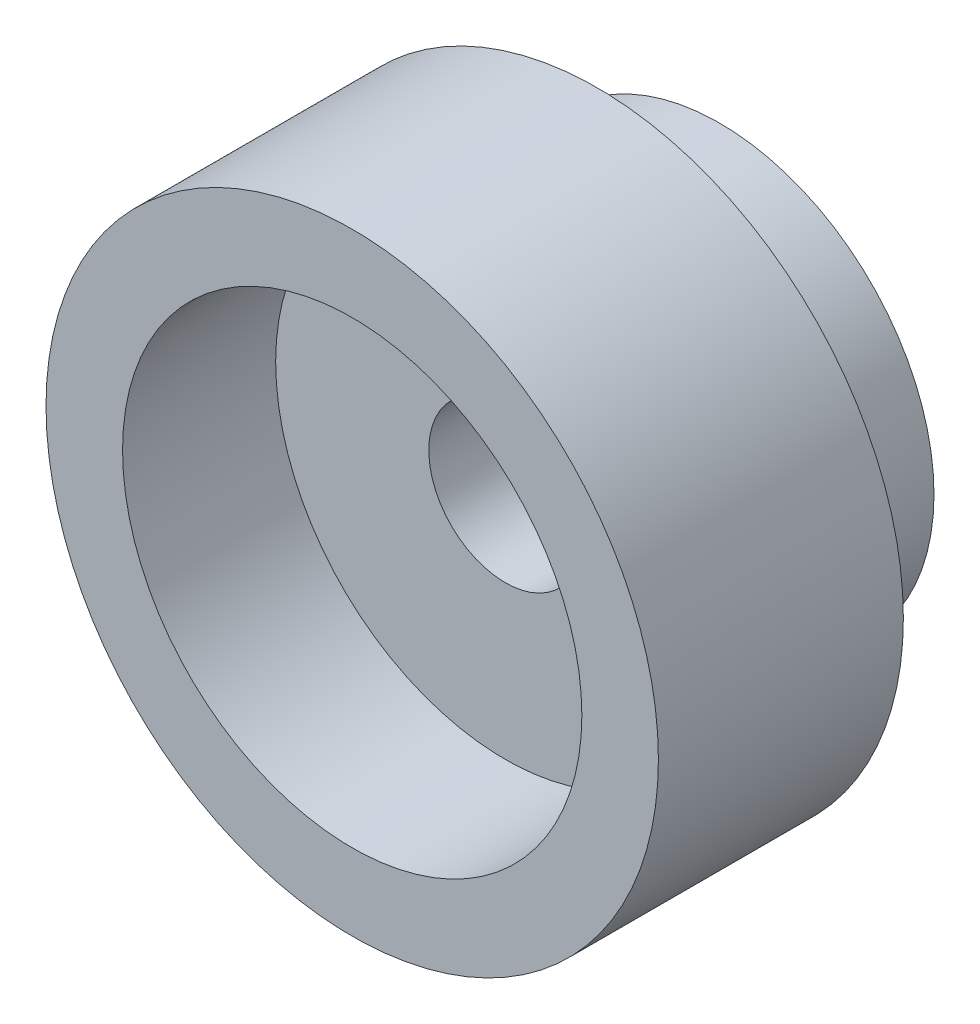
ISO-10303-21;
HEADER;
FILE_DESCRIPTION(('STEP AP214'),'2;1');
FILE_NAME('part.step','',(''),(''),'','','');
FILE_SCHEMA(('AUTOMOTIVE_DESIGN { 1 0 10303 214 1 1 1 1 }'));
ENDSEC;
DATA;
#1=APPLICATION_CONTEXT('core data for automotive mechanical design processes');
#2=APPLICATION_PROTOCOL_DEFINITION('international standard','automotive_design',2000,#1);
#3=PRODUCT_CONTEXT('',#1,'mechanical');
#4=PRODUCT('Part','Part','',(#3));
#5=PRODUCT_RELATED_PRODUCT_CATEGORY('part','',(#4));
#6=PRODUCT_DEFINITION_FORMATION('','',#4);
#7=PRODUCT_DEFINITION_CONTEXT('part definition',#1,'design');
#8=PRODUCT_DEFINITION('design','',#6,#7);
#9=PRODUCT_DEFINITION_SHAPE('','',#8);
#10=(LENGTH_UNIT() NAMED_UNIT(*) SI_UNIT(.MILLI.,.METRE.));
#11=(NAMED_UNIT(*) PLANE_ANGLE_UNIT() SI_UNIT($,.RADIAN.));
#12=(NAMED_UNIT(*) SI_UNIT($,.STERADIAN.) SOLID_ANGLE_UNIT());
#13=UNCERTAINTY_MEASURE_WITH_UNIT(LENGTH_MEASURE(1.E-05),#10,'distance_accuracy_value','');
#14=(GEOMETRIC_REPRESENTATION_CONTEXT(3) GLOBAL_UNCERTAINTY_ASSIGNED_CONTEXT((#13)) GLOBAL_UNIT_ASSIGNED_CONTEXT((#10,
#11,#12)) REPRESENTATION_CONTEXT('',''));
#15=CARTESIAN_POINT('',(0.,0.,0.));
#16=DIRECTION('',(0.,0.,1.));
#17=DIRECTION('',(1.,0.,0.));
#18=AXIS2_PLACEMENT_3D('',#15,#16,#17);
#19=CARTESIAN_POINT('',(0.,0.,20.));
#20=DIRECTION('',(0.,0.,1.));
#21=DIRECTION('',(1.,0.,0.));
#22=AXIS2_PLACEMENT_3D('',#19,#20,#21);
#23=CYLINDRICAL_SURFACE('',#22,7.);
#24=CARTESIAN_POINT('',(0.,0.,0.));
#25=DIRECTION('',(0.,0.,1.));
#26=DIRECTION('',(1.,0.,0.));
#27=AXIS2_PLACEMENT_3D('',#24,#25,#26);
#28=CIRCLE('',#27,7.);
#29=CARTESIAN_POINT('',(7.,0.,0.));
#30=VERTEX_POINT('',#29);
#31=EDGE_CURVE('E8',#30,#30,#28,.T.);
#32=ORIENTED_EDGE('',*,*,#31,.T.);
#33=EDGE_LOOP('',(#32));
#34=FACE_BOUND('',#33,.T.);
#35=CARTESIAN_POINT('',(0.,0.,4.));
#36=DIRECTION('',(0.,0.,1.));
#37=DIRECTION('',(1.,0.,0.));
#38=AXIS2_PLACEMENT_3D('',#35,#36,#37);
#39=CIRCLE('',#38,7.);
#40=CARTESIAN_POINT('',(7.,0.,4.));
#41=VERTEX_POINT('',#40);
#42=EDGE_CURVE('E25',#41,#41,#39,.T.);
#43=ORIENTED_EDGE('',*,*,#42,.F.);
#44=EDGE_LOOP('',(#43));
#45=FACE_BOUND('',#44,.T.);
#46=CARTESIAN_POINT('',(0.,7.,1.8));
#47=CARTESIAN_POINT('',(-0.0392142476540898,6.99999954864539,1.80000169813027));
#48=CARTESIAN_POINT('',(-0.0784544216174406,6.99966697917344,1.80330628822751));
#49=CARTESIAN_POINT('',(-0.155846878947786,6.99837227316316,1.8164390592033));
#50=CARTESIAN_POINT('',(-0.19399791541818,6.99740944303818,1.82627442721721));
#51=CARTESIAN_POINT('',(-0.26808017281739,6.99496290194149,1.85217956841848));
#52=CARTESIAN_POINT('',(-0.304012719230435,6.99347950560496,1.86824557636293));
#53=CARTESIAN_POINT('',(-0.372663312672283,6.99015770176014,1.90614863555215));
#54=CARTESIAN_POINT('',(-0.405381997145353,6.98831936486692,1.92798453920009));
#55=CARTESIAN_POINT('',(-0.466801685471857,6.98448621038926,1.97689188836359));
#56=CARTESIAN_POINT('',(-0.495489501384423,6.98249091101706,2.00397985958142));
#57=CARTESIAN_POINT('',(-0.547919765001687,6.97857269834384,2.06258717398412));
#58=CARTESIAN_POINT('',(-0.571661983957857,6.97664978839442,2.09410672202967));
#59=CARTESIAN_POINT('',(-0.613573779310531,6.97308914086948,2.16076497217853));
#60=CARTESIAN_POINT('',(-0.631731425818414,6.97145201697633,2.1959112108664));
#61=CARTESIAN_POINT('',(-0.66188246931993,6.96865426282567,2.26877291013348));
#62=CARTESIAN_POINT('',(-0.673876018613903,6.96749362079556,2.30648830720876));
#63=CARTESIAN_POINT('',(-0.691319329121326,6.96578458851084,2.3832832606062));
#64=CARTESIAN_POINT('',(-0.696790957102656,6.96523415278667,2.42235780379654));
#65=CARTESIAN_POINT('',(-0.701102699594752,6.96480150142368,2.50087420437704));
#66=CARTESIAN_POINT('',(-0.69994298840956,6.96491926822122,2.54031605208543));
#67=CARTESIAN_POINT('',(-0.691042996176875,6.96580784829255,2.61829671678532));
#68=CARTESIAN_POINT('',(-0.683326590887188,6.96657629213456,2.65683828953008));
#69=CARTESIAN_POINT('',(-0.661569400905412,6.96867594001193,2.73207657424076));
#70=CARTESIAN_POINT('',(-0.647528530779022,6.97000715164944,2.76877326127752));
#71=CARTESIAN_POINT('',(-0.613494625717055,6.97308506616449,2.83935551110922));
#72=CARTESIAN_POINT('',(-0.593490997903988,6.9748325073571,2.87323593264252));
#73=CARTESIAN_POINT('',(-0.548107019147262,6.97854536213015,2.93716765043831));
#74=CARTESIAN_POINT('',(-0.522726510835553,6.9805107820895,2.96721883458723));
#75=CARTESIAN_POINT('',(-0.467175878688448,6.98444869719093,3.02277777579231));
#76=CARTESIAN_POINT('',(-0.436985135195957,6.98642118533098,3.04826492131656));
#77=CARTESIAN_POINT('',(-0.372742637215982,6.99014280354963,3.09381254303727));
#78=CARTESIAN_POINT('',(-0.338690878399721,6.99189193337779,3.11387301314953));
#79=CARTESIAN_POINT('',(-0.267678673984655,6.99497032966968,3.14799701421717));
#80=CARTESIAN_POINT('',(-0.230717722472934,6.99629952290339,3.16205949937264));
#81=CARTESIAN_POINT('',(-0.154943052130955,6.99838753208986,3.18377324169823));
#82=CARTESIAN_POINT('',(-0.116129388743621,6.99914636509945,3.19142469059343));
#83=CARTESIAN_POINT('',(-0.0379295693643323,7.00000596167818,3.20007301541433));
#84=CARTESIAN_POINT('',(0.00145341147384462,7.00010953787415,3.20109833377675));
#85=CARTESIAN_POINT('',(0.0798306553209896,6.99965449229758,3.19653999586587));
#86=CARTESIAN_POINT('',(0.118824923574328,6.99909587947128,3.1909564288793));
#87=CARTESIAN_POINT('',(0.195235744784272,6.99738103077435,3.17336241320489));
#88=CARTESIAN_POINT('',(0.232655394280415,6.99622603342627,3.16136528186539));
#89=CARTESIAN_POINT('',(0.304951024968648,6.99344799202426,3.13129837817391));
#90=CARTESIAN_POINT('',(0.339826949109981,6.99182493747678,3.11322846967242));
#91=CARTESIAN_POINT('',(0.406173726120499,6.98828532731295,3.07145841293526));
#92=CARTESIAN_POINT('',(0.437632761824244,6.98636780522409,3.04773957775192));
#93=CARTESIAN_POINT('',(0.496133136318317,6.98245753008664,2.99537175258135));
#94=CARTESIAN_POINT('',(0.523174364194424,6.9804647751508,2.96672263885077));
#95=CARTESIAN_POINT('',(0.572170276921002,6.97662016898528,2.9051833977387));
#96=CARTESIAN_POINT('',(0.594106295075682,6.97476885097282,2.87227837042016));
#97=CARTESIAN_POINT('',(0.632140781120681,6.97142482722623,2.80323484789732));
#98=CARTESIAN_POINT('',(0.648239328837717,6.96993211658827,2.76709639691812));
#99=CARTESIAN_POINT('',(0.674110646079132,6.96747763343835,2.69267588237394));
#100=CARTESIAN_POINT('',(0.683894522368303,6.96651492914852,2.65439771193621));
#101=CARTESIAN_POINT('',(0.696894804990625,6.96522655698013,2.57673176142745));
#102=CARTESIAN_POINT('',(0.700111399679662,6.9649008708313,2.53734401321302));
#103=CARTESIAN_POINT('',(0.699883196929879,6.96492379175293,2.4587625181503));
#104=CARTESIAN_POINT('',(0.696467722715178,6.96526943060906,2.41956868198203));
#105=CARTESIAN_POINT('',(0.683133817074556,6.96658972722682,2.3423145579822));
#106=CARTESIAN_POINT('',(0.673215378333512,6.96756438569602,2.30425427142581));
#107=CARTESIAN_POINT('',(0.647165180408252,6.9700320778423,2.2303478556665));
#108=CARTESIAN_POINT('',(0.631034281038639,6.97152503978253,2.19450142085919));
#109=CARTESIAN_POINT('',(0.593020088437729,6.97486126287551,2.12602017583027));
#110=CARTESIAN_POINT('',(0.57113682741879,6.97670452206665,2.09338534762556));
#111=CARTESIAN_POINT('',(0.522128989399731,6.98054341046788,2.03210342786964));
#112=CARTESIAN_POINT('',(0.494982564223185,6.98253965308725,2.00347384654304));
#113=CARTESIAN_POINT('',(0.436262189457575,6.98645398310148,1.95116343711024));
#114=CARTESIAN_POINT('',(0.40468718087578,6.98837205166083,1.92748379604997));
#115=CARTESIAN_POINT('',(0.337919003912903,6.99191893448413,1.88569858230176));
#116=CARTESIAN_POINT('',(0.302716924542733,6.99354700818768,1.86760719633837));
#117=CARTESIAN_POINT('',(0.229780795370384,6.99632240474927,1.83761630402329));
#118=CARTESIAN_POINT('',(0.192049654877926,6.99747026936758,1.82570981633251));
#119=CARTESIAN_POINT('',(0.128420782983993,6.99886749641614,1.81139556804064));
#120=CARTESIAN_POINT('',(0.102929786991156,6.99929020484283,1.80712806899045));
#121=CARTESIAN_POINT('',(0.0516296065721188,6.9998566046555,1.80142973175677));
#122=CARTESIAN_POINT('',(0.0258204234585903,7.00000029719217,1.7999988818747));
#123=CARTESIAN_POINT('',(0.,7.,1.8));
#124=B_SPLINE_CURVE_WITH_KNOTS('',3,(#46,#47,#48,#49,#50,#51,#52,#53,#54,#55,#56,#57,#58,#59,
#60,#61,#62,#63,#64,#65,#66,#67,#68,#69,#70,#71,#72,#73,#74,#75,#76,#77,#78,#79,#80,#81,#82,#83,
#84,#85,#86,#87,#88,#89,#90,#91,#92,#93,#94,#95,#96,#97,#98,#99,#100,#101,#102,#103,#104,#105,
#106,#107,#108,#109,#110,#111,#112,#113,#114,#115,#116,#117,#118,#119,#120,#121,#122,#123),
.UNSPECIFIED.,.T.,.F.,(4,2,2,2,2,2,2,2,2,2,2,2,2,2,2,2,2,2,2,2,2,2,2,2,2,2,2,2,2,2,2,2,2,2,2,2,
2,2,4),(0.,0.117548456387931,0.235226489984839,0.35283352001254,0.470417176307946,
0.58837699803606,0.706342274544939,0.82455782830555,0.942770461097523,1.06058562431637,
1.17839769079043,1.29578258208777,1.41316905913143,1.53076532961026,1.64836504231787,
1.76648313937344,1.8846013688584,2.00274018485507,2.12087546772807,2.2385033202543,
2.356129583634,2.47351254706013,2.59089814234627,2.70867758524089,2.82645998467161,
2.94466650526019,3.06287140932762,3.18086783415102,3.2988608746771,3.41633340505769,
3.53380606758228,3.6512624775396,3.76871822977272,3.88667242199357,4.0046548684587,
4.12293441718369,4.24108016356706,4.31847967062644,4.39587885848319),.UNSPECIFIED.);
#125=CARTESIAN_POINT('',(0.,7.,1.8));
#126=VERTEX_POINT('',#125);
#127=EDGE_CURVE('E49',#126,#126,#124,.T.);
#128=ORIENTED_EDGE('',*,*,#127,.F.);
#129=EDGE_LOOP('',(#128));
#130=FACE_BOUND('',#129,.T.);
#131=ADVANCED_FACE('F12',(#34,#45,#130),#23,.T.);
#132=CARTESIAN_POINT('',(0.,0.,20.));
#133=DIRECTION('',(0.,0.,1.));
#134=DIRECTION('',(1.,0.,0.));
#135=AXIS2_PLACEMENT_3D('',#132,#133,#134);
#136=CYLINDRICAL_SURFACE('',#135,2.5);
#137=CARTESIAN_POINT('',(0.,0.,0.));
#138=DIRECTION('',(0.,0.,1.));
#139=DIRECTION('',(1.,0.,0.));
#140=AXIS2_PLACEMENT_3D('',#137,#138,#139);
#141=CIRCLE('',#140,2.5);
#142=CARTESIAN_POINT('',(2.5,0.,0.));
#143=VERTEX_POINT('',#142);
#144=EDGE_CURVE('E46',#143,#143,#141,.T.);
#145=ORIENTED_EDGE('',*,*,#144,.F.);
#146=EDGE_LOOP('',(#145));
#147=FACE_BOUND('',#146,.T.);
#148=CARTESIAN_POINT('',(0.,0.,7.));
#149=DIRECTION('',(0.,0.,1.));
#150=DIRECTION('',(1.,0.,0.));
#151=AXIS2_PLACEMENT_3D('',#148,#149,#150);
#152=CIRCLE('',#151,2.5);
#153=CARTESIAN_POINT('',(2.5,0.,7.));
#154=VERTEX_POINT('',#153);
#155=EDGE_CURVE('E43',#154,#154,#152,.T.);
#156=ORIENTED_EDGE('',*,*,#155,.T.);
#157=EDGE_LOOP('',(#156));
#158=FACE_BOUND('',#157,.T.);
#159=CARTESIAN_POINT('',(0.,2.5,1.8));
#160=CARTESIAN_POINT('',(-0.0385163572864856,2.49999950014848,1.80000075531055));
#161=CARTESIAN_POINT('',(-0.0770405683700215,2.49910122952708,1.80318956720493));
#162=CARTESIAN_POINT('',(-0.152974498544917,2.49560527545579,1.8158350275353));
#163=CARTESIAN_POINT('',(-0.190383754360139,2.49300689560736,1.82529424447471));
#164=CARTESIAN_POINT('',(-0.262981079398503,2.48639671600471,1.85014532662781));
#165=CARTESIAN_POINT('',(-0.298172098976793,2.48238684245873,1.86552910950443));
#166=CARTESIAN_POINT('',(-0.365474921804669,2.47337471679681,1.90176142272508));
#167=CARTESIAN_POINT('',(-0.397586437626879,2.46837237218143,1.92261046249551));
#168=CARTESIAN_POINT('',(-0.458632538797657,2.45777110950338,1.96973895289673));
#169=CARTESIAN_POINT('',(-0.487477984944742,2.45216118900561,1.99613139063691));
#170=CARTESIAN_POINT('',(-0.54039664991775,2.44104570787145,2.05335625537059));
#171=CARTESIAN_POINT('',(-0.564469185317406,2.43554016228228,2.08418931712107));
#172=CARTESIAN_POINT('',(-0.607606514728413,2.42514279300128,2.15014816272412));
#173=CARTESIAN_POINT('',(-0.626566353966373,2.42026477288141,2.18534496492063));
#174=CARTESIAN_POINT('',(-0.658263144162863,2.41183758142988,2.25858564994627));
#175=CARTESIAN_POINT('',(-0.671001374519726,2.40828813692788,2.29662894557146));
#176=CARTESIAN_POINT('',(-0.689579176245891,2.40303398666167,2.37348994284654));
#177=CARTESIAN_POINT('',(-0.695581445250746,2.40128586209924,2.41226527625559));
#178=CARTESIAN_POINT('',(-0.701024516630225,2.39970276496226,2.49030891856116));
#179=CARTESIAN_POINT('',(-0.700466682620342,2.39986739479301,2.52957712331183));
#180=CARTESIAN_POINT('',(-0.692934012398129,2.40205249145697,2.60620185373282));
#181=CARTESIAN_POINT('',(-0.68615867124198,2.40401525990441,2.64357990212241));
#182=CARTESIAN_POINT('',(-0.666703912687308,2.40948272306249,2.71664617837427));
#183=CARTESIAN_POINT('',(-0.654023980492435,2.41298755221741,2.75233425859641));
#184=CARTESIAN_POINT('',(-0.622963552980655,2.4211931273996,2.82151507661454));
#185=CARTESIAN_POINT('',(-0.604515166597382,2.4259079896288,2.85497558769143));
#186=CARTESIAN_POINT('',(-0.562488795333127,2.43599511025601,2.91839479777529));
#187=CARTESIAN_POINT('',(-0.538909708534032,2.44136750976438,2.94835274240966));
#188=CARTESIAN_POINT('',(-0.486282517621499,2.45240217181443,3.00505313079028));
#189=CARTESIAN_POINT('',(-0.457067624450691,2.45806789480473,3.03164033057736));
#190=CARTESIAN_POINT('',(-0.394523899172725,2.46887759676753,3.07957156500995));
#191=CARTESIAN_POINT('',(-0.361194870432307,2.4740215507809,3.10091534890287));
#192=CARTESIAN_POINT('',(-0.291112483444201,2.4832453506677,3.13783206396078));
#193=CARTESIAN_POINT('',(-0.254342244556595,2.48731953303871,3.15337445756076));
#194=CARTESIAN_POINT('',(-0.178570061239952,2.49390390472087,3.17801088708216));
#195=CARTESIAN_POINT('',(-0.139568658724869,2.49641447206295,3.187106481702));
#196=CARTESIAN_POINT('',(-0.0617641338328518,2.49953054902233,3.19834170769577));
#197=CARTESIAN_POINT('',(-0.0229937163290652,2.50019377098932,3.20069213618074));
#198=CARTESIAN_POINT('',(0.054388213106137,2.49970766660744,3.19895581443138));
#199=CARTESIAN_POINT('',(0.092999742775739,2.49855854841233,3.19486980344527));
#200=CARTESIAN_POINT('',(0.168198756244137,2.49461437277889,3.18054863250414));
#201=CARTESIAN_POINT('',(0.204810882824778,2.49185138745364,3.17043321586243));
#202=CARTESIAN_POINT('',(0.275813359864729,2.48499503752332,3.14448135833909));
#203=CARTESIAN_POINT('',(0.310203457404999,2.48090152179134,3.12864426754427));
#204=CARTESIAN_POINT('',(0.376588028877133,2.47170566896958,3.09132216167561));
#205=CARTESIAN_POINT('',(0.408516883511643,2.46658392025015,3.06972533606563));
#206=CARTESIAN_POINT('',(0.46837052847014,2.45592239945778,3.02163549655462));
#207=CARTESIAN_POINT('',(0.49629444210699,2.45038253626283,2.9951414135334));
#208=CARTESIAN_POINT('',(0.54824969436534,2.43929314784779,2.93702218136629));
#209=CARTESIAN_POINT('',(0.572131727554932,2.43374875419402,2.90526231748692));
#210=CARTESIAN_POINT('',(0.614233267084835,2.42346630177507,2.8380667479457));
#211=CARTESIAN_POINT('',(0.632452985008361,2.41872821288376,2.80263117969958));
#212=CARTESIAN_POINT('',(0.66257784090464,2.41065012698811,2.72924776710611));
#213=CARTESIAN_POINT('',(0.674517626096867,2.40730248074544,2.69131503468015));
#214=CARTESIAN_POINT('',(0.691814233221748,2.40238953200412,2.61386892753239));
#215=CARTESIAN_POINT('',(0.697172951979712,2.40082371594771,2.57435601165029));
#216=CARTESIAN_POINT('',(0.701038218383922,2.39969766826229,2.49640812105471));
#217=CARTESIAN_POINT('',(0.699785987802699,2.40006682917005,2.45798595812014));
#218=CARTESIAN_POINT('',(0.691030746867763,2.4026020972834,2.38192403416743));
#219=CARTESIAN_POINT('',(0.68352792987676,2.40476814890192,2.34428424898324));
#220=CARTESIAN_POINT('',(0.66263076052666,2.41060897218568,2.27119410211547));
#221=CARTESIAN_POINT('',(0.649292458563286,2.41426936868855,2.23572648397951));
#222=CARTESIAN_POINT('',(0.617146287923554,2.42268555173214,2.1675047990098));
#223=CARTESIAN_POINT('',(0.598337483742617,2.42744152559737,2.13475119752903));
#224=CARTESIAN_POINT('',(0.555074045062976,2.43770413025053,2.0717481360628));
#225=CARTESIAN_POINT('',(0.530457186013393,2.44322999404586,2.0416131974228));
#226=CARTESIAN_POINT('',(0.476578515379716,2.4543080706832,1.985823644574));
#227=CARTESIAN_POINT('',(0.447315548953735,2.45986028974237,1.96017014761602));
#228=CARTESIAN_POINT('',(0.384117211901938,2.47052712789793,1.91345494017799));
#229=CARTESIAN_POINT('',(0.350085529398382,2.47562782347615,1.89252005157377));
#230=CARTESIAN_POINT('',(0.2788431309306,2.48465934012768,1.85670069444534));
#231=CARTESIAN_POINT('',(0.241634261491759,2.48859083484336,1.84181274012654));
#232=CARTESIAN_POINT('',(0.170526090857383,2.4943954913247,1.82022033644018));
#233=CARTESIAN_POINT('',(0.136902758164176,2.49648109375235,1.81265641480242));
#234=CARTESIAN_POINT('',(0.0688549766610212,2.49928348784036,1.80254621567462));
#235=CARTESIAN_POINT('',(0.0344306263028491,2.50000044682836,1.79999932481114));
#236=CARTESIAN_POINT('',(0.,2.5,1.8));
#237=B_SPLINE_CURVE_WITH_KNOTS('',3,(#159,#160,#161,#162,#163,#164,#165,#166,#167,#168,#169,
#170,#171,#172,#173,#174,#175,#176,#177,#178,#179,#180,#181,#182,#183,#184,#185,#186,#187,#188,
#189,#190,#191,#192,#193,#194,#195,#196,#197,#198,#199,#200,#201,#202,#203,#204,#205,#206,#207,
#208,#209,#210,#211,#212,#213,#214,#215,#216,#217,#218,#219,#220,#221,#222,#223,#224,#225,#226,
#227,#228,#229,#230,#231,#232,#233,#234,#235,#236),.UNSPECIFIED.,.T.,.F.,(4,2,2,2,2,2,2,2,2,2,2,
2,2,2,2,2,2,2,2,2,2,2,2,2,2,2,2,2,2,2,2,2,2,2,2,2,2,2,4),(0.,0.115422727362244,
0.230892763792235,0.346205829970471,0.461529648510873,0.57948315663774,0.697453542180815,
0.817687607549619,0.937896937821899,1.05513571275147,1.17235011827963,1.28593029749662,
1.39952038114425,1.51450114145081,1.62950662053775,1.7486664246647,1.86783192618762,
1.98761613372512,2.10737137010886,2.22334100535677,2.33929732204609,2.45302408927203,
2.56676377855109,2.68289629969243,2.79905420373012,2.91885013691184,3.03864159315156,
3.15776502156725,3.27685410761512,3.39162856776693,3.50639947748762,3.62009140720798,
3.73380279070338,3.85117389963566,3.96857422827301,4.08882926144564,4.20901487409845,
4.31220642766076,4.41538536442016),.UNSPECIFIED.);
#238=CARTESIAN_POINT('',(0.,2.5,1.8));
#239=VERTEX_POINT('',#238);
#240=EDGE_CURVE('E16',#239,#239,#237,.T.);
#241=ORIENTED_EDGE('',*,*,#240,.T.);
#242=EDGE_LOOP('',(#241));
#243=FACE_BOUND('',#242,.T.);
#244=ADVANCED_FACE('F61',(#147,#158,#243),#136,.F.);
#245=CARTESIAN_POINT('',(-2.5,0.,0.));
#246=DIRECTION('',(0.,0.,1.));
#247=DIRECTION('',(1.,0.,0.));
#248=AXIS2_PLACEMENT_3D('',#245,#246,#247);
#249=PLANE('',#248);
#250=ORIENTED_EDGE('',*,*,#31,.F.);
#251=EDGE_LOOP('',(#250));
#252=FACE_BOUND('',#251,.T.);
#253=ORIENTED_EDGE('',*,*,#144,.T.);
#254=EDGE_LOOP('',(#253));
#255=FACE_BOUND('',#254,.T.);
#256=ADVANCED_FACE('F14',(#252,#255),#249,.F.);
#257=CARTESIAN_POINT('',(-7.,0.,4.));
#258=DIRECTION('',(0.,0.,1.));
#259=DIRECTION('',(1.,0.,0.));
#260=AXIS2_PLACEMENT_3D('',#257,#258,#259);
#261=PLANE('',#260);
#262=CARTESIAN_POINT('',(0.,0.,4.));
#263=DIRECTION('',(0.,0.,1.));
#264=DIRECTION('',(1.,0.,0.));
#265=AXIS2_PLACEMENT_3D('',#262,#263,#264);
#266=CIRCLE('',#265,10.);
#267=CARTESIAN_POINT('',(10.,0.,4.));
#268=VERTEX_POINT('',#267);
#269=EDGE_CURVE('E29',#268,#268,#266,.T.);
#270=ORIENTED_EDGE('',*,*,#269,.F.);
#271=EDGE_LOOP('',(#270));
#272=FACE_BOUND('',#271,.T.);
#273=ORIENTED_EDGE('',*,*,#42,.T.);
#274=EDGE_LOOP('',(#273));
#275=FACE_BOUND('',#274,.T.);
#276=ADVANCED_FACE('F80',(#272,#275),#261,.F.);
#277=CARTESIAN_POINT('',(0.,0.,20.));
#278=DIRECTION('',(0.,0.,1.));
#279=DIRECTION('',(1.,0.,0.));
#280=AXIS2_PLACEMENT_3D('',#277,#278,#279);
#281=CYLINDRICAL_SURFACE('',#280,10.);
#282=ORIENTED_EDGE('',*,*,#269,.T.);
#283=EDGE_LOOP('',(#282));
#284=FACE_BOUND('',#283,.T.);
#285=CARTESIAN_POINT('',(0.,0.,12.));
#286=DIRECTION('',(0.,0.,1.));
#287=DIRECTION('',(1.,0.,0.));
#288=AXIS2_PLACEMENT_3D('',#285,#286,#287);
#289=CIRCLE('',#288,10.);
#290=CARTESIAN_POINT('',(10.,0.,12.));
#291=VERTEX_POINT('',#290);
#292=EDGE_CURVE('E34',#291,#291,#289,.T.);
#293=ORIENTED_EDGE('',*,*,#292,.F.);
#294=EDGE_LOOP('',(#293));
#295=FACE_BOUND('',#294,.T.);
#296=ADVANCED_FACE('F77',(#284,#295),#281,.T.);
#297=CARTESIAN_POINT('',(-7.5,0.,12.));
#298=DIRECTION('',(0.,0.,1.));
#299=DIRECTION('',(1.,0.,0.));
#300=AXIS2_PLACEMENT_3D('',#297,#298,#299);
#301=PLANE('',#300);
#302=ORIENTED_EDGE('',*,*,#292,.T.);
#303=EDGE_LOOP('',(#302));
#304=FACE_BOUND('',#303,.T.);
#305=CARTESIAN_POINT('',(0.,0.,12.));
#306=DIRECTION('',(0.,0.,1.));
#307=DIRECTION('',(1.,0.,0.));
#308=AXIS2_PLACEMENT_3D('',#305,#306,#307);
#309=CIRCLE('',#308,7.5);
#310=CARTESIAN_POINT('',(7.5,0.,12.));
#311=VERTEX_POINT('',#310);
#312=EDGE_CURVE('E37',#311,#311,#309,.T.);
#313=ORIENTED_EDGE('',*,*,#312,.F.);
#314=EDGE_LOOP('',(#313));
#315=FACE_BOUND('',#314,.T.);
#316=ADVANCED_FACE('F73',(#304,#315),#301,.T.);
#317=CARTESIAN_POINT('',(0.,0.,20.));
#318=DIRECTION('',(0.,0.,1.));
#319=DIRECTION('',(1.,0.,0.));
#320=AXIS2_PLACEMENT_3D('',#317,#318,#319);
#321=CYLINDRICAL_SURFACE('',#320,7.5);
#322=ORIENTED_EDGE('',*,*,#312,.T.);
#323=EDGE_LOOP('',(#322));
#324=FACE_BOUND('',#323,.T.);
#325=CARTESIAN_POINT('',(0.,0.,7.));
#326=DIRECTION('',(0.,0.,1.));
#327=DIRECTION('',(1.,0.,0.));
#328=AXIS2_PLACEMENT_3D('',#325,#326,#327);
#329=CIRCLE('',#328,7.5);
#330=CARTESIAN_POINT('',(7.5,0.,7.));
#331=VERTEX_POINT('',#330);
#332=EDGE_CURVE('E40',#331,#331,#329,.T.);
#333=ORIENTED_EDGE('',*,*,#332,.F.);
#334=EDGE_LOOP('',(#333));
#335=FACE_BOUND('',#334,.T.);
#336=ADVANCED_FACE('F69',(#324,#335),#321,.F.);
#337=CARTESIAN_POINT('',(-2.5,0.,7.));
#338=DIRECTION('',(0.,0.,1.));
#339=DIRECTION('',(1.,0.,0.));
#340=AXIS2_PLACEMENT_3D('',#337,#338,#339);
#341=PLANE('',#340);
#342=ORIENTED_EDGE('',*,*,#332,.T.);
#343=EDGE_LOOP('',(#342));
#344=FACE_BOUND('',#343,.T.);
#345=ORIENTED_EDGE('',*,*,#155,.F.);
#346=EDGE_LOOP('',(#345));
#347=FACE_BOUND('',#346,.T.);
#348=ADVANCED_FACE('F59',(#344,#347),#341,.T.);
#349=CARTESIAN_POINT('',(0.,10.,2.5));
#350=DIRECTION('',(0.,-1.,0.));
#351=DIRECTION('',(0.,0.,-1.));
#352=AXIS2_PLACEMENT_3D('',#349,#350,#351);
#353=CYLINDRICAL_SURFACE('',#352,0.7);
#354=ORIENTED_EDGE('',*,*,#240,.F.);
#355=EDGE_LOOP('',(#354));
#356=FACE_BOUND('',#355,.T.);
#357=ORIENTED_EDGE('',*,*,#127,.T.);
#358=EDGE_LOOP('',(#357));
#359=FACE_BOUND('',#358,.T.);
#360=ADVANCED_FACE('F56',(#356,#359),#353,.F.);
#361=CLOSED_SHELL('',(#131,#244,#256,#276,#296,#316,#336,#348,#360));
#362=MANIFOLD_SOLID_BREP('B1',#361);
#363=ADVANCED_BREP_SHAPE_REPRESENTATION('',(#18,#362),#14);
#364=SHAPE_DEFINITION_REPRESENTATION(#9,#363);
ENDSEC;
END-ISO-10303-21;
